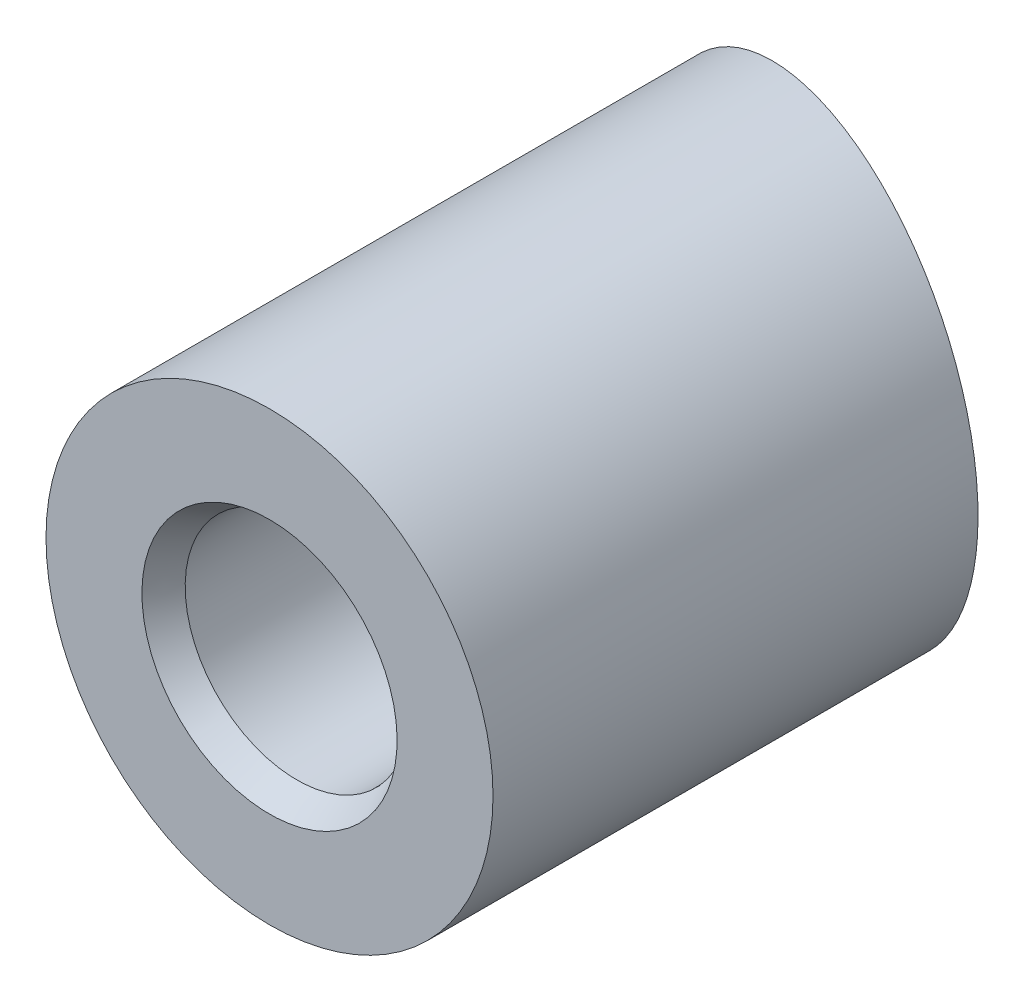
ISO-10303-21;
HEADER;
FILE_DESCRIPTION(('STEP AP214'),'2;1');
FILE_NAME('part.step','',(''),(''),'','','');
FILE_SCHEMA(('AUTOMOTIVE_DESIGN { 1 0 10303 214 1 1 1 1 }'));
ENDSEC;
DATA;
#1=APPLICATION_CONTEXT('core data for automotive mechanical design processes');
#2=APPLICATION_PROTOCOL_DEFINITION('international standard','automotive_design',2000,#1);
#3=PRODUCT_CONTEXT('',#1,'mechanical');
#4=PRODUCT('Part','Part','',(#3));
#5=PRODUCT_RELATED_PRODUCT_CATEGORY('part','',(#4));
#6=PRODUCT_DEFINITION_FORMATION('','',#4);
#7=PRODUCT_DEFINITION_CONTEXT('part definition',#1,'design');
#8=PRODUCT_DEFINITION('design','',#6,#7);
#9=PRODUCT_DEFINITION_SHAPE('','',#8);
#10=(LENGTH_UNIT() NAMED_UNIT(*) SI_UNIT(.MILLI.,.METRE.));
#11=(NAMED_UNIT(*) PLANE_ANGLE_UNIT() SI_UNIT($,.RADIAN.));
#12=(NAMED_UNIT(*) SI_UNIT($,.STERADIAN.) SOLID_ANGLE_UNIT());
#13=UNCERTAINTY_MEASURE_WITH_UNIT(LENGTH_MEASURE(1.E-05),#10,'distance_accuracy_value','');
#14=(GEOMETRIC_REPRESENTATION_CONTEXT(3) GLOBAL_UNCERTAINTY_ASSIGNED_CONTEXT((#13)) GLOBAL_UNIT_ASSIGNED_CONTEXT((#10,
#11,#12)) REPRESENTATION_CONTEXT('',''));
#15=CARTESIAN_POINT('',(0.,0.,0.));
#16=DIRECTION('',(0.,0.,1.));
#17=DIRECTION('',(1.,0.,0.));
#18=AXIS2_PLACEMENT_3D('',#15,#16,#17);
#19=CARTESIAN_POINT('',(0.,0.,0.));
#20=DIRECTION('',(0.,0.,-1.));
#21=DIRECTION('',(0.,-1.,0.));
#22=AXIS2_PLACEMENT_3D('',#19,#20,#21);
#23=CYLINDRICAL_SURFACE('',#22,12.);
#24=CARTESIAN_POINT('',(0.,0.,0.));
#25=DIRECTION('',(0.,0.,1.));
#26=DIRECTION('',(0.,1.,0.));
#27=AXIS2_PLACEMENT_3D('',#24,#25,#26);
#28=CIRCLE('',#27,12.);
#29=CARTESIAN_POINT('',(0.,12.,0.));
#30=VERTEX_POINT('',#29);
#31=EDGE_CURVE('E32',#30,#30,#28,.T.);
#32=ORIENTED_EDGE('',*,*,#31,.F.);
#33=EDGE_LOOP('',(#32));
#34=FACE_BOUND('',#33,.T.);
#35=CARTESIAN_POINT('',(0.,0.,-70.2309928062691));
#36=DIRECTION('',(0.965925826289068,0.,0.258819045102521));
#37=DIRECTION('',(0.258819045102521,0.,-0.965925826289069));
#38=AXIS2_PLACEMENT_3D('',#35,#36,#37);
#39=ELLIPSE('',#38,46.3644396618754,12.);
#40=CARTESIAN_POINT('',(-10.2439006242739,6.25,-32.0002352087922));
#41=VERTEX_POINT('',#40);
#42=CARTESIAN_POINT('',(-10.2439006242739,-6.25,-32.0002352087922));
#43=VERTEX_POINT('',#42);
#44=EDGE_CURVE('E30',#41,#43,#39,.T.);
#45=ORIENTED_EDGE('',*,*,#44,.T.);
#46=CARTESIAN_POINT('',(0.,0.,-29.2553903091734));
#47=DIRECTION('',(-0.258819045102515,0.,0.96592582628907));
#48=DIRECTION('',(-0.96592582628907,0.,-0.258819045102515));
#49=AXIS2_PLACEMENT_3D('',#46,#47,#48);
#50=ELLIPSE('',#49,12.423314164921,12.);
#51=EDGE_CURVE('E22',#43,#41,#50,.T.);
#52=ORIENTED_EDGE('',*,*,#51,.T.);
#53=EDGE_LOOP('',(#45,#52));
#54=FACE_BOUND('',#53,.T.);
#55=ADVANCED_FACE('F14',(#34,#54),#23,.T.);
#56=CARTESIAN_POINT('',(0.,0.,0.));
#57=DIRECTION('',(0.,0.,1.));
#58=DIRECTION('',(0.,1.,0.));
#59=AXIS2_PLACEMENT_3D('',#56,#57,#58);
#60=PLANE('',#59);
#61=CARTESIAN_POINT('',(0.,0.,0.));
#62=DIRECTION('',(0.,0.,1.));
#63=DIRECTION('',(0.,1.,0.));
#64=AXIS2_PLACEMENT_3D('',#61,#62,#63);
#65=CIRCLE('',#64,6.85);
#66=CARTESIAN_POINT('',(0.,6.85,0.));
#67=VERTEX_POINT('',#66);
#68=EDGE_CURVE('E45',#67,#67,#65,.T.);
#69=ORIENTED_EDGE('',*,*,#68,.F.);
#70=EDGE_LOOP('',(#69));
#71=FACE_BOUND('',#70,.T.);
#72=ORIENTED_EDGE('',*,*,#31,.T.);
#73=EDGE_LOOP('',(#72));
#74=FACE_BOUND('',#73,.T.);
#75=ADVANCED_FACE('F40',(#71,#74),#60,.T.);
#76=CARTESIAN_POINT('',(12.,-6.25,-26.04));
#77=DIRECTION('',(-0.258819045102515,0.,0.96592582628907));
#78=DIRECTION('',(0.96592582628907,0.,0.258819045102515));
#79=AXIS2_PLACEMENT_3D('',#76,#77,#78);
#80=PLANE('',#79);
#81=ORIENTED_EDGE('',*,*,#51,.F.);
#82=DIRECTION('',(0.,1.,0.));
#83=VECTOR('',#82,1.);
#84=CARTESIAN_POINT('',(-10.2439006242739,-6.25,-32.0002352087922));
#85=LINE('',#84,#83);
#86=EDGE_CURVE('E9',#43,#41,#85,.T.);
#87=ORIENTED_EDGE('',*,*,#86,.T.);
#88=EDGE_LOOP('',(#81,#87));
#89=FACE_BOUND('',#88,.T.);
#90=CARTESIAN_POINT('',(0.749457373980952,0.,-29.0545738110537));
#91=DIRECTION('',(-0.258819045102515,0.,0.96592582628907));
#92=DIRECTION('',(0.96592582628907,0.,0.258819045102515));
#93=AXIS2_PLACEMENT_3D('',#90,#91,#92);
#94=ELLIPSE('',#93,1.739900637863,1.50425406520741);
#95=CARTESIAN_POINT('',(2.43007233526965,0.,-28.6042543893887));
#96=VERTEX_POINT('',#95);
#97=EDGE_CURVE('E17',#96,#96,#94,.T.);
#98=ORIENTED_EDGE('',*,*,#97,.T.);
#99=EDGE_LOOP('',(#98));
#100=FACE_BOUND('',#99,.T.);
#101=ADVANCED_FACE('F37',(#89,#100),#80,.F.);
#102=CARTESIAN_POINT('',(-10.2439006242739,-12.,-32.0002352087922));
#103=DIRECTION('',(0.965925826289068,0.,0.258819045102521));
#104=DIRECTION('',(0.258819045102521,0.,-0.965925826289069));
#105=AXIS2_PLACEMENT_3D('',#102,#103,#104);
#106=PLANE('',#105);
#107=ORIENTED_EDGE('',*,*,#86,.F.);
#108=ORIENTED_EDGE('',*,*,#44,.F.);
#109=EDGE_LOOP('',(#107,#108));
#110=FACE_BOUND('',#109,.T.);
#111=ADVANCED_FACE('F35',(#110),#106,.F.);
#112=CARTESIAN_POINT('',(0.,0.,-27.));
#113=DIRECTION('',(0.,0.,1.));
#114=DIRECTION('',(0.,1.,0.));
#115=AXIS2_PLACEMENT_3D('',#112,#113,#114);
#116=CONICAL_SURFACE('',#115,5.1,1.02974425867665);
#117=CARTESIAN_POINT('',(0.,0.,-27.));
#118=DIRECTION('',(0.,0.,1.));
#119=DIRECTION('',(0.,1.,0.));
#120=AXIS2_PLACEMENT_3D('',#117,#118,#119);
#121=CIRCLE('',#120,5.1);
#122=CARTESIAN_POINT('',(0.,5.1,-27.));
#123=VERTEX_POINT('',#122);
#124=EDGE_CURVE('E97',#123,#123,#121,.T.);
#125=ORIENTED_EDGE('',*,*,#124,.T.);
#126=EDGE_LOOP('',(#125));
#127=FACE_BOUND('',#126,.T.);
#128=ORIENTED_EDGE('',*,*,#97,.F.);
#129=EDGE_LOOP('',(#128));
#130=FACE_BOUND('',#129,.T.);
#131=ADVANCED_FACE('F73',(#127,#130),#116,.F.);
#132=CARTESIAN_POINT('',(0.,0.,0.));
#133=DIRECTION('',(0.,0.,1.));
#134=DIRECTION('',(0.,1.,0.));
#135=AXIS2_PLACEMENT_3D('',#132,#133,#134);
#136=CONICAL_SURFACE('',#135,6.85,0.523598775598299);
#137=CARTESIAN_POINT('',(0.,0.,-1.47224318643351));
#138=DIRECTION('',(0.,0.,1.));
#139=DIRECTION('',(0.,1.,0.));
#140=AXIS2_PLACEMENT_3D('',#137,#138,#139);
#141=CIRCLE('',#140,6.);
#142=CARTESIAN_POINT('',(0.,6.,-1.47224318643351));
#143=VERTEX_POINT('',#142);
#144=EDGE_CURVE('E47',#143,#143,#141,.T.);
#145=ORIENTED_EDGE('',*,*,#144,.F.);
#146=EDGE_LOOP('',(#145));
#147=FACE_BOUND('',#146,.T.);
#148=ORIENTED_EDGE('',*,*,#68,.T.);
#149=EDGE_LOOP('',(#148));
#150=FACE_BOUND('',#149,.T.);
#151=ADVANCED_FACE('F74',(#147,#150),#136,.F.);
#152=CARTESIAN_POINT('',(0.,0.,0.));
#153=DIRECTION('',(0.,0.,1.));
#154=DIRECTION('',(0.,1.,0.));
#155=AXIS2_PLACEMENT_3D('',#152,#153,#154);
#156=CYLINDRICAL_SURFACE('',#155,6.);
#157=CARTESIAN_POINT('',(0.,0.,-24.));
#158=DIRECTION('',(0.,0.,1.));
#159=DIRECTION('',(0.,1.,0.));
#160=AXIS2_PLACEMENT_3D('',#157,#158,#159);
#161=CIRCLE('',#160,6.);
#162=CARTESIAN_POINT('',(0.,6.,-24.));
#163=VERTEX_POINT('',#162);
#164=EDGE_CURVE('E52',#163,#163,#161,.T.);
#165=ORIENTED_EDGE('',*,*,#164,.F.);
#166=EDGE_LOOP('',(#165));
#167=FACE_BOUND('',#166,.T.);
#168=ORIENTED_EDGE('',*,*,#144,.T.);
#169=EDGE_LOOP('',(#168));
#170=FACE_BOUND('',#169,.T.);
#171=ADVANCED_FACE('F77',(#167,#170),#156,.F.);
#172=CARTESIAN_POINT('',(0.,5.1,-24.));
#173=DIRECTION('',(0.,0.,-1.));
#174=DIRECTION('',(0.,-1.,0.));
#175=AXIS2_PLACEMENT_3D('',#172,#173,#174);
#176=PLANE('',#175);
#177=CARTESIAN_POINT('',(0.,0.,-24.));
#178=DIRECTION('',(0.,0.,1.));
#179=DIRECTION('',(0.,1.,0.));
#180=AXIS2_PLACEMENT_3D('',#177,#178,#179);
#181=CIRCLE('',#180,5.1);
#182=CARTESIAN_POINT('',(0.,5.1,-24.));
#183=VERTEX_POINT('',#182);
#184=EDGE_CURVE('E98',#183,#183,#181,.T.);
#185=ORIENTED_EDGE('',*,*,#184,.F.);
#186=EDGE_LOOP('',(#185));
#187=FACE_BOUND('',#186,.T.);
#188=ORIENTED_EDGE('',*,*,#164,.T.);
#189=EDGE_LOOP('',(#188));
#190=FACE_BOUND('',#189,.T.);
#191=ADVANCED_FACE('F81',(#187,#190),#176,.F.);
#192=CARTESIAN_POINT('',(0.,0.,0.));
#193=DIRECTION('',(0.,0.,1.));
#194=DIRECTION('',(0.,1.,0.));
#195=AXIS2_PLACEMENT_3D('',#192,#193,#194);
#196=CYLINDRICAL_SURFACE('',#195,5.1);
#197=ORIENTED_EDGE('',*,*,#124,.F.);
#198=EDGE_LOOP('',(#197));
#199=FACE_BOUND('',#198,.T.);
#200=ORIENTED_EDGE('',*,*,#184,.T.);
#201=EDGE_LOOP('',(#200));
#202=FACE_BOUND('',#201,.T.);
#203=ADVANCED_FACE('F85',(#199,#202),#196,.F.);
#204=CLOSED_SHELL('',(#55,#75,#101,#111,#131,#151,#171,#191,#203));
#205=MANIFOLD_SOLID_BREP('B1',#204);
#206=ADVANCED_BREP_SHAPE_REPRESENTATION('',(#18,#205),#14);
#207=SHAPE_DEFINITION_REPRESENTATION(#9,#206);
ENDSEC;
END-ISO-10303-21;
